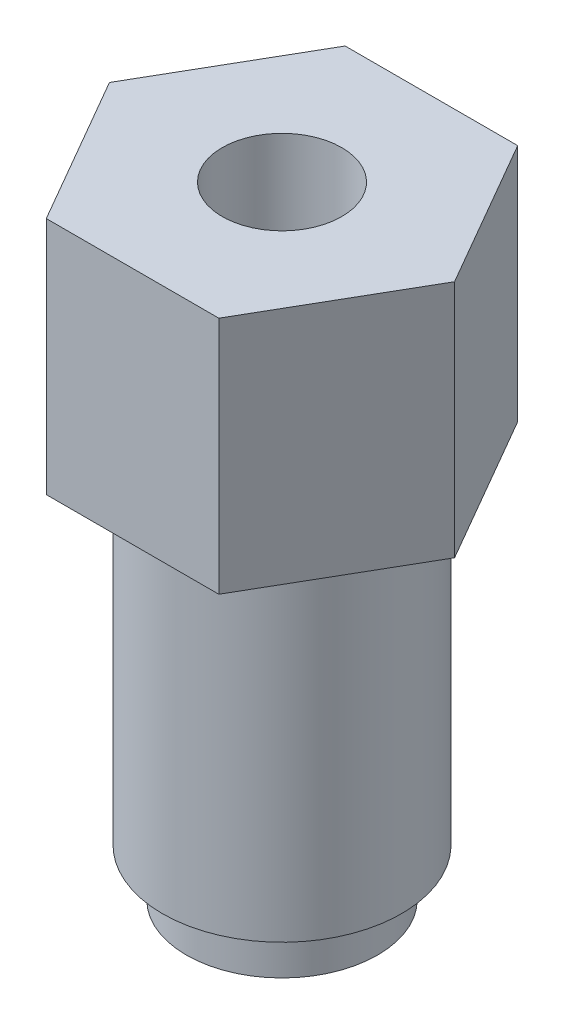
from build123d import *

# Parameters (mm, degrees)
SKETCH2_OUTSIDE_W  = 15.786
SKETCH2_OUTSIDE_H  = 15.786
CUT_EXTRUDE1_DEPTH = 18.830953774


with BuildPart() as part:
    # Sketch1 → Revolve1 (revolve)
    with BuildSketch(Plane.XY, mode=Mode.PRIVATE) as revolve1_sk:
        Polygon((-1.5875, 0), (-2.54, 0), (-2.54, 1.27), (-3.175, 1.27), (-3.175, 10.16), (-4.7625, 10.16), (-4.7625, 16.51), (-1.5875, 16.51), align=None)
    revolve(revolve1_sk.sketch.rotate(Axis((0, 0, 0), (0, 1, 0)), 270), axis=Axis((0, 0, 0), (0, 1, 0)))

    # Sketch2 outside → Cut-Extrude1 (cut, through all)
    with BuildSketch(Plane(origin=(0, 16.51, 0), x_dir=(1, 0, 0), z_dir=(0, 1, 0))):
        Rectangle(SKETCH2_OUTSIDE_W, SKETCH2_OUTSIDE_H)
        Polygon((4.582717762, 0), (2.291358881, 3.96875), (-2.291358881, 3.96875), (-4.582717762, 0), (-2.291358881, -3.96875), (2.291358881, -3.96875), align=None, mode=Mode.SUBTRACT)
    extrude(amount=-CUT_EXTRUDE1_DEPTH, mode=Mode.SUBTRACT)


solid = part.part
